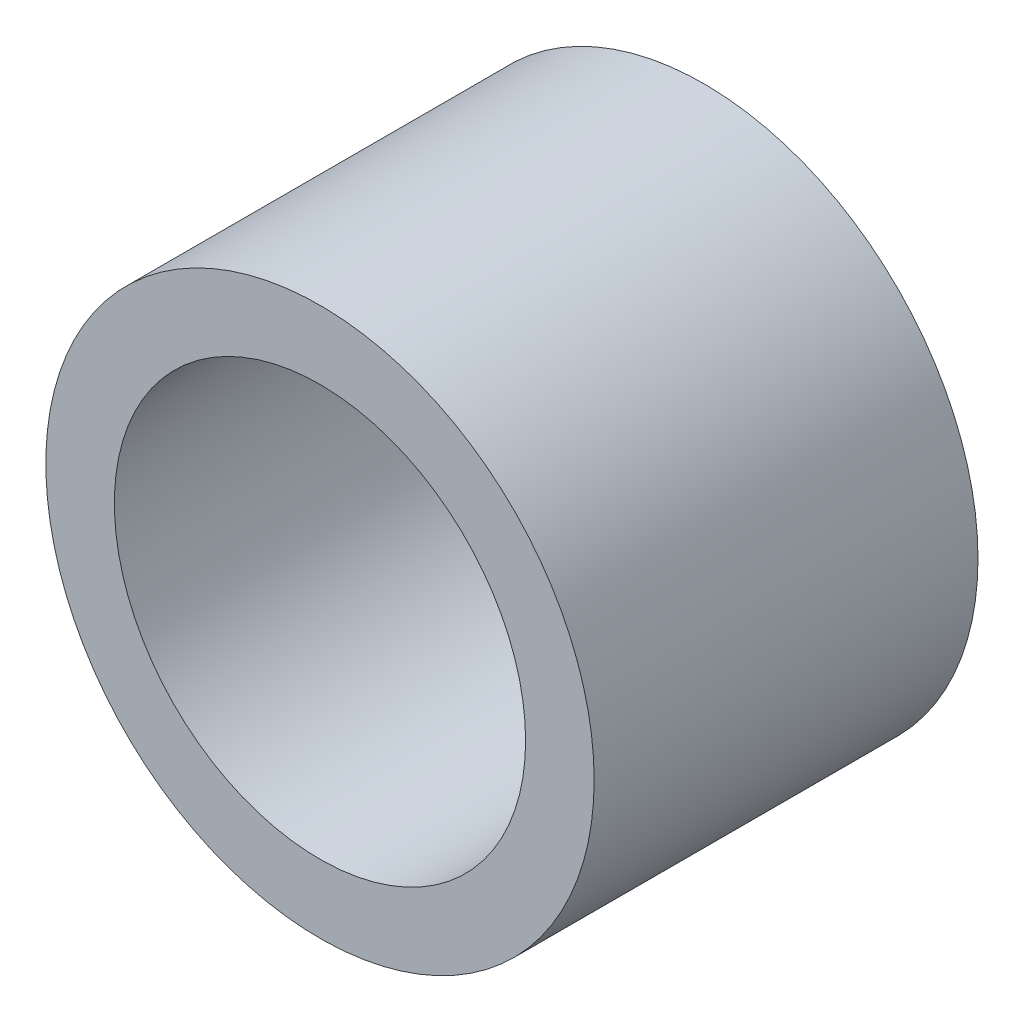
ISO-10303-21;
HEADER;
FILE_DESCRIPTION(('STEP AP214'),'2;1');
FILE_NAME('part.step','',(''),(''),'','','');
FILE_SCHEMA(('AUTOMOTIVE_DESIGN { 1 0 10303 214 1 1 1 1 }'));
ENDSEC;
DATA;
#1=APPLICATION_CONTEXT('core data for automotive mechanical design processes');
#2=APPLICATION_PROTOCOL_DEFINITION('international standard','automotive_design',2000,#1);
#3=PRODUCT_CONTEXT('',#1,'mechanical');
#4=PRODUCT('Part','Part','',(#3));
#5=PRODUCT_RELATED_PRODUCT_CATEGORY('part','',(#4));
#6=PRODUCT_DEFINITION_FORMATION('','',#4);
#7=PRODUCT_DEFINITION_CONTEXT('part definition',#1,'design');
#8=PRODUCT_DEFINITION('design','',#6,#7);
#9=PRODUCT_DEFINITION_SHAPE('','',#8);
#10=(LENGTH_UNIT() NAMED_UNIT(*) SI_UNIT(.MILLI.,.METRE.));
#11=(NAMED_UNIT(*) PLANE_ANGLE_UNIT() SI_UNIT($,.RADIAN.));
#12=(NAMED_UNIT(*) SI_UNIT($,.STERADIAN.) SOLID_ANGLE_UNIT());
#13=UNCERTAINTY_MEASURE_WITH_UNIT(LENGTH_MEASURE(1.E-05),#10,'distance_accuracy_value','');
#14=(GEOMETRIC_REPRESENTATION_CONTEXT(3) GLOBAL_UNCERTAINTY_ASSIGNED_CONTEXT((#13)) GLOBAL_UNIT_ASSIGNED_CONTEXT((#10,
#11,#12)) REPRESENTATION_CONTEXT('',''));
#15=CARTESIAN_POINT('',(0.,0.,0.));
#16=DIRECTION('',(0.,0.,1.));
#17=DIRECTION('',(1.,0.,0.));
#18=AXIS2_PLACEMENT_3D('',#15,#16,#17);
#19=CARTESIAN_POINT('',(-38.0999999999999,0.,-8.89));
#20=DIRECTION('',(0.,0.,1.));
#21=DIRECTION('',(1.,0.,0.));
#22=AXIS2_PLACEMENT_3D('',#19,#20,#21);
#23=CYLINDRICAL_SURFACE('',#22,6.35);
#24=CARTESIAN_POINT('',(-38.0999999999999,0.,-8.89));
#25=DIRECTION('',(0.,0.,1.));
#26=DIRECTION('',(1.,0.,0.));
#27=AXIS2_PLACEMENT_3D('',#24,#25,#26);
#28=CIRCLE('',#27,6.35);
#29=CARTESIAN_POINT('',(-31.7499999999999,0.,-8.89));
#30=VERTEX_POINT('',#29);
#31=EDGE_CURVE('E10',#30,#30,#28,.T.);
#32=ORIENTED_EDGE('',*,*,#31,.T.);
#33=EDGE_LOOP('',(#32));
#34=FACE_BOUND('',#33,.T.);
#35=CARTESIAN_POINT('',(-38.0999999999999,0.,0.));
#36=DIRECTION('',(0.,0.,1.));
#37=DIRECTION('',(1.,0.,0.));
#38=AXIS2_PLACEMENT_3D('',#35,#36,#37);
#39=CIRCLE('',#38,6.35);
#40=CARTESIAN_POINT('',(-31.7499999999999,0.,0.));
#41=VERTEX_POINT('',#40);
#42=EDGE_CURVE('E32',#41,#41,#39,.T.);
#43=ORIENTED_EDGE('',*,*,#42,.F.);
#44=EDGE_LOOP('',(#43));
#45=FACE_BOUND('',#44,.T.);
#46=ADVANCED_FACE('F29',(#34,#45),#23,.T.);
#47=CARTESIAN_POINT('',(-38.0999999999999,0.,-8.89));
#48=DIRECTION('',(0.,0.,1.));
#49=DIRECTION('',(1.,0.,0.));
#50=AXIS2_PLACEMENT_3D('',#47,#48,#49);
#51=PLANE('',#50);
#52=CARTESIAN_POINT('',(-38.0999999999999,0.,-8.89));
#53=DIRECTION('',(0.,0.,1.));
#54=DIRECTION('',(1.,0.,0.));
#55=AXIS2_PLACEMENT_3D('',#52,#53,#54);
#56=CIRCLE('',#55,4.7625);
#57=CARTESIAN_POINT('',(-33.3374999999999,0.,-8.89));
#58=VERTEX_POINT('',#57);
#59=EDGE_CURVE('E39',#58,#58,#56,.T.);
#60=ORIENTED_EDGE('',*,*,#59,.T.);
#61=EDGE_LOOP('',(#60));
#62=FACE_BOUND('',#61,.T.);
#63=ORIENTED_EDGE('',*,*,#31,.F.);
#64=EDGE_LOOP('',(#63));
#65=FACE_BOUND('',#64,.T.);
#66=ADVANCED_FACE('F47',(#62,#65),#51,.F.);
#67=CARTESIAN_POINT('',(-38.0999999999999,0.,0.));
#68=DIRECTION('',(0.,0.,1.));
#69=DIRECTION('',(1.,0.,0.));
#70=AXIS2_PLACEMENT_3D('',#67,#68,#69);
#71=PLANE('',#70);
#72=CARTESIAN_POINT('',(-38.0999999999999,0.,0.));
#73=DIRECTION('',(0.,0.,1.));
#74=DIRECTION('',(1.,0.,0.));
#75=AXIS2_PLACEMENT_3D('',#72,#73,#74);
#76=CIRCLE('',#75,4.7625);
#77=CARTESIAN_POINT('',(-33.3374999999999,0.,0.));
#78=VERTEX_POINT('',#77);
#79=EDGE_CURVE('E41',#78,#78,#76,.T.);
#80=ORIENTED_EDGE('',*,*,#79,.F.);
#81=EDGE_LOOP('',(#80));
#82=FACE_BOUND('',#81,.T.);
#83=ORIENTED_EDGE('',*,*,#42,.T.);
#84=EDGE_LOOP('',(#83));
#85=FACE_BOUND('',#84,.T.);
#86=ADVANCED_FACE('F53',(#82,#85),#71,.T.);
#87=CARTESIAN_POINT('',(-38.0999999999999,0.,-8.89));
#88=DIRECTION('',(0.,0.,1.));
#89=DIRECTION('',(1.,0.,0.));
#90=AXIS2_PLACEMENT_3D('',#87,#88,#89);
#91=CYLINDRICAL_SURFACE('',#90,4.7625);
#92=ORIENTED_EDGE('',*,*,#59,.F.);
#93=EDGE_LOOP('',(#92));
#94=FACE_BOUND('',#93,.T.);
#95=ORIENTED_EDGE('',*,*,#79,.T.);
#96=EDGE_LOOP('',(#95));
#97=FACE_BOUND('',#96,.T.);
#98=ADVANCED_FACE('F50',(#94,#97),#91,.F.);
#99=CLOSED_SHELL('',(#46,#66,#86,#98));
#100=MANIFOLD_SOLID_BREP('B2',#99);
#101=ADVANCED_BREP_SHAPE_REPRESENTATION('',(#18,#100),#14);
#102=SHAPE_DEFINITION_REPRESENTATION(#9,#101);
ENDSEC;
END-ISO-10303-21;
